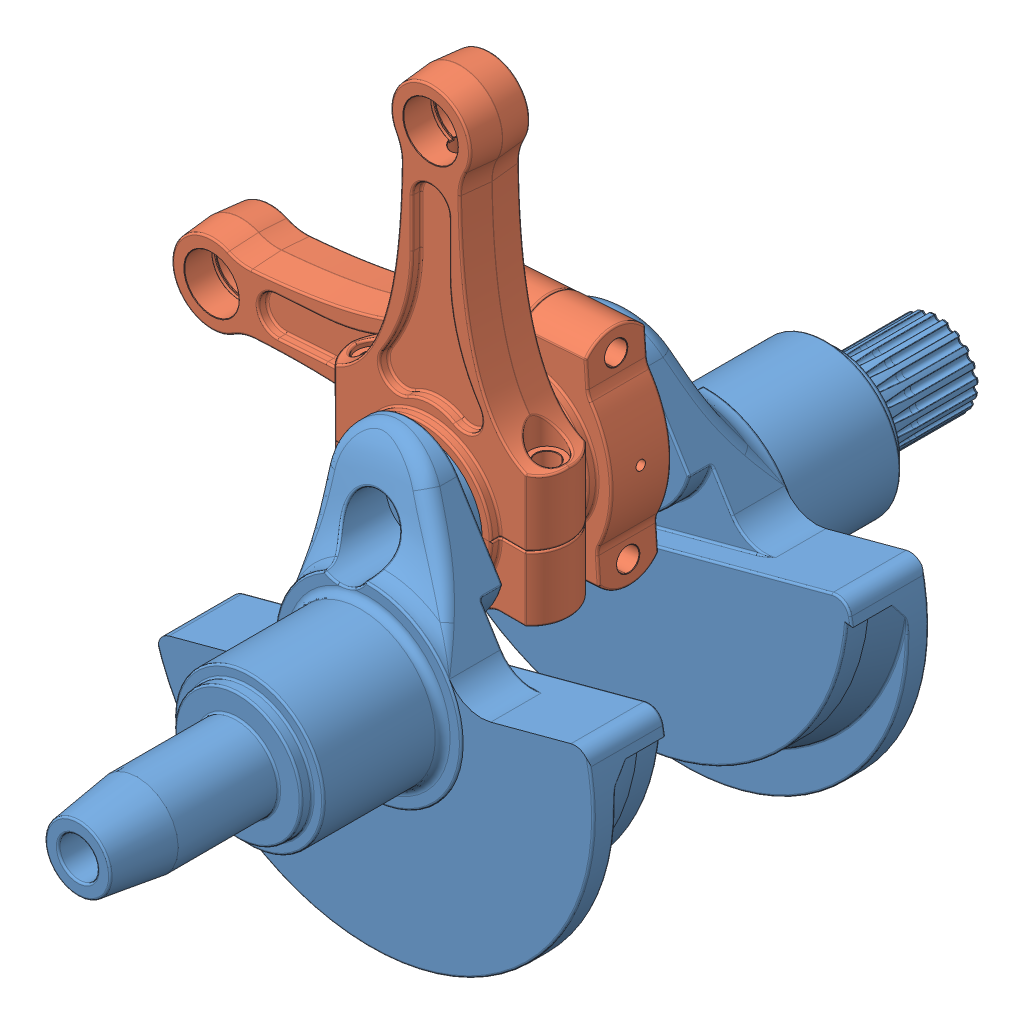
SolidWorks assembly 03_04_Add Sub Assemblies.SLDASM, configuration Default (file format 7000). Lengths in mm.
Overall size (358.5 397.52 462).
6 component instances, 2 part files, 16 mates.
Components (placement in the parent):
- Flywheel Final-1: Flywheel Final.SLDPRT [Taper Shaft] x (0.965926 0.258819 0) z (0 0 1) size (239.43 220 247)
- Conrod Final-1: Conrod Final.SLDPRT [ConRod Cup] at (-15.5291 57.9555 -64) size (117 45 42.18)
- Conrod Final-2: Conrod Final.SLDPRT [ConRod] at (-15.5291 57.9555 -64) size (117.32 192.67 42.18)
- Flywheel Final-2: Flywheel Final.SLDPRT [Spline Shaft] at (0 0 -180) x (-0.965926 -0.258819 0) z (0 0 -1) size (239.43 220 215)
- Conrod Final-5: Conrod Final.SLDPRT [ConRod Cup] at (-15.5291 57.9555 -116) x (0.069421 -0.997587 0) z (0 0 -1) size (117 45 42.18)
- Conrod Final-6: Conrod Final.SLDPRT [ConRod] at (-15.5291 57.9555 -116) x (0.069421 -0.997587 0) z (0 0 -1) size (117.32 192.67 42.18)
Mates (geometry in assembly coordinates):
- Coincident1: coincident aligned: plane of Flywheel Final-1 through (0 0 0) normal (0 0 1); plane of assembly through (0 0 0) normal (0 0 1)
- Angle1: planar angle = 0.261799 rad aligned: plane of Flywheel Final-1 through (0 0 -308.3282) normal (-0.258819 0.965926 0); plane of assembly through (0 0 0) normal (0 1 0)
- Coincident2: coincident: point of Flywheel Final-1; point of assembly
- Concentric1: concentric anti-aligned: cylinder of Flywheel Final-1 through (-15.5291 57.9555 -90) axis (0 0 1) radius 30; cylinder of Conrod Final-1 through (-15.5291 57.9555 -43) axis (0 0 -1) radius 32.5
- Distance1: distance = 3 mm anti-aligned: plane of Conrod Final-1 through (-15.5291 57.9555 -43) normal (0 0 1); plane of Flywheel Final-1 through (0 0 -40) normal (0 0 -1)
- Concentric2: concentric anti-aligned: cylinder of Flywheel Final-1 through (-15.5291 57.9555 -90) axis (0 0 1) radius 30; cylinder of Conrod Final-2 through (-15.5291 57.9555 -43) axis (0 0 -1) radius 32.5
- Distance2: distance = 3 mm anti-aligned: plane of Conrod Final-2 through (-15.5291 57.9555 -43) normal (0 0 1); plane of Flywheel Final-1 through (0 0 -40) normal (0 0 -1)
- Coincident4: coincident anti-aligned: plane of Conrod Final-1 through (-15.5291 57.9555 -64) normal (0 1 0); plane of Conrod Final-2 through (-15.5291 57.9555 -64) normal (0 -1 0)
- Concentric3: concentric anti-aligned: cylinder of Flywheel Final-1 through (-15.5291 57.9555 -90) axis (0 0 1) radius 30; cylinder of Flywheel Final-2 through (-15.5291 57.9555 -90) axis (0 0 -1) radius 30
- Coincident5: coincident anti-aligned: plane of Flywheel Final-1 through (-15.5291 57.9555 -90) normal (0 0 -1); plane of Flywheel Final-2 through (-15.5291 57.9555 -90) normal (0 0 1)
- Parallel1: parallel aligned: plane of Flywheel Final-1 through (0 0 -308.3282) normal (-0.258819 0.965926 0); plane of Flywheel Final-2 through (0 0 128.3282) normal (-0.258819 0.965926 0)
- Concentric6: concentric anti-aligned: cylinder of Flywheel Final-2 through (-15.5291 57.9555 -90) axis (0 0 -1) radius 30; cylinder of Conrod Final-5 through (-15.5291 57.9555 -137) axis (0 0 1) radius 32.5
- Distance5: distance = 3 mm anti-aligned: plane of Conrod Final-5 through (-15.5291 57.9555 -137) normal (0 0 -1); plane of Flywheel Final-2 through (0 0 -140) normal (0 0 1)
- Concentric7: concentric anti-aligned: cylinder of Flywheel Final-2 through (-15.5291 57.9555 -90) axis (0 0 -1) radius 30; cylinder of Conrod Final-6 through (-15.5291 57.9555 -137) axis (0 0 1) radius 32.5
- Distance6: distance = 3 mm anti-aligned: plane of Conrod Final-6 through (-15.5291 57.9555 -137) normal (0 0 -1); plane of Flywheel Final-2 through (0 0 -140) normal (0 0 1)
- Coincident6: coincident anti-aligned: plane of Conrod Final-5 through (-15.5291 57.9555 -116) normal (-0.997587 -0.069421 0); plane of Conrod Final-6 through (-15.5291 57.9555 -116) normal (0.997587 0.069421 0)
